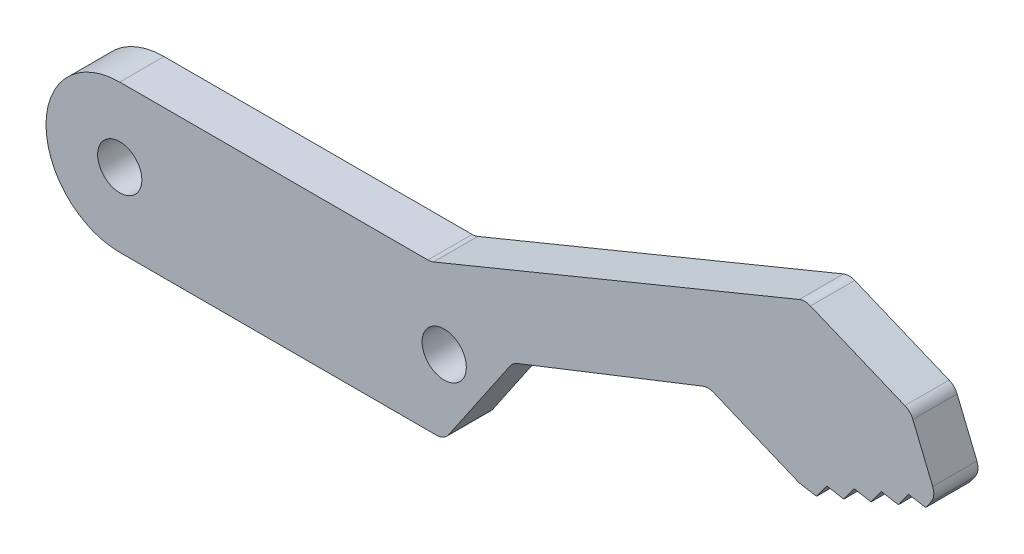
from build123d import *

# Parameters (mm, degrees)
SKETCH1_R           = 1.5
BOSS_EXTRUDE1_DEPTH = 3
FILLET1_R           = 1


with BuildPart() as part:
    # Sketch1 → Boss-Extrude1 (new body)
    with BuildSketch(Plane.XY):
        with BuildLine():
            Line((21.092544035, 5), (0, 5))
            ThreePointArc((0, 5), (-5, 0), (0, -5))
            Line((0, -5), (22, -5))
            Line((22, -5), (26.651778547, 1.833291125))
            Line((26.651778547, 1.833291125), (39.900043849, 7.05450425))
            Line((39.900043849, 7.05450425), (46.081819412, 4.495151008))
            Line((46.081819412, 4.495151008), (47.244362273, 4.297365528))
            Line((47.244362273, 4.297365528), (47.931575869, 5.255677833))
            Line((47.931575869, 5.255677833), (49.09411873, 5.057892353))
            Line((49.09411873, 5.057892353), (49.781332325, 6.016204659))
            Line((49.781332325, 6.016204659), (50.943875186, 5.818419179))
            Line((50.943875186, 5.818419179), (51.631088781, 6.776731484))
            Line((51.631088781, 6.776731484), (52.793631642, 6.578946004))
            Line((52.793631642, 6.578946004), (53.480845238, 7.53725831))
            Line((53.480845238, 7.53725831), (54.643388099, 7.33947283))
            Line((54.643388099, 7.33947283), (55.330601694, 8.297785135))
            Line((55.330601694, 8.297785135), (53.619416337, 12.459737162))
            Line((53.619416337, 12.459737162), (46.452761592, 15.426846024))
            Line((46.452761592, 15.426846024), (21.092544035, 5))
        make_face()
        Circle(SKETCH1_R, mode=Mode.SUBTRACT)
        with Locations((22, 0)):
            Circle(SKETCH1_R, mode=Mode.SUBTRACT)
    extrude(amount=BOSS_EXTRUDE1_DEPTH)

    # Fillet1
    fillet1_edges = [part.edges().sort_by_distance(p)[0] for p in [
        (21.092544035, 5, 1.5),
        (46.452761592, 15.426846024, 1.5),
        (53.619416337, 12.459737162, 1.5),
        (55.330601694, 8.297785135, 1.5),
        (46.081819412, 4.495151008, 1.5),
        (39.900043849, 7.05450425, 1.5),
        (26.651778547, 1.833291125, 1.5),
        (22, -5, 1.5),
    ]]
    fillet(fillet1_edges, radius=FILLET1_R)


solid = part.part
